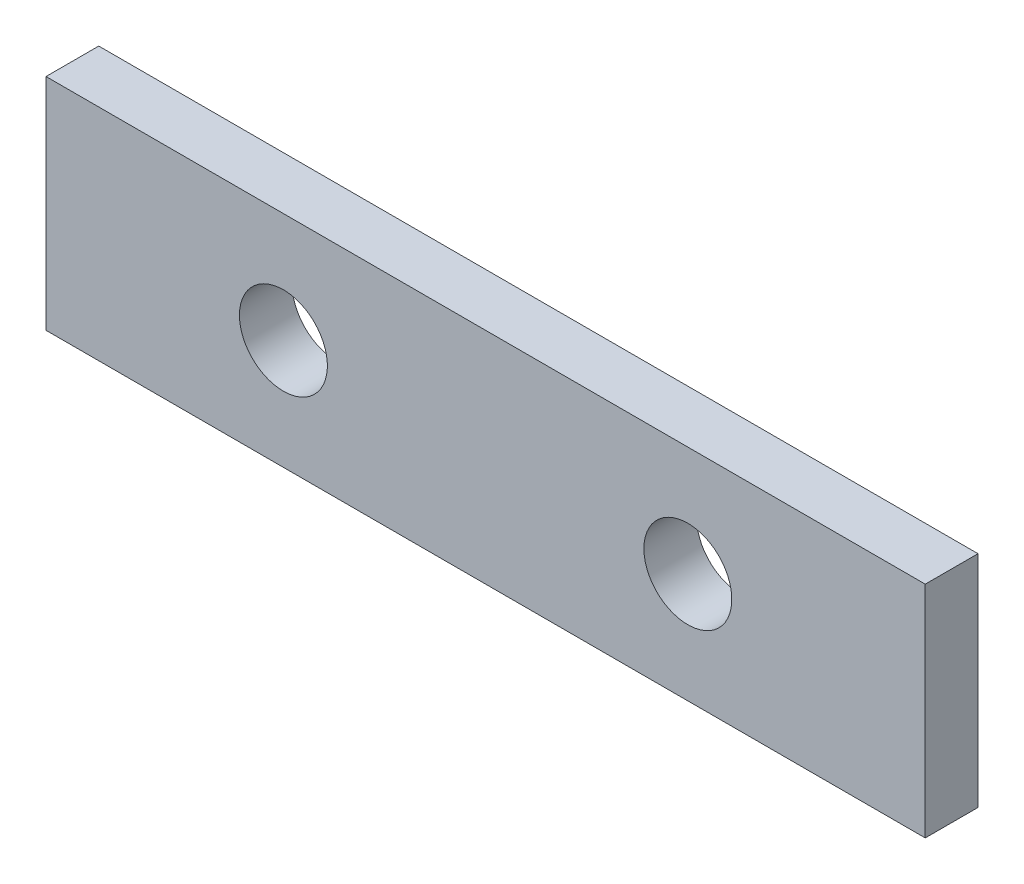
ISO-10303-21;
HEADER;
FILE_DESCRIPTION(('STEP AP214'),'2;1');
FILE_NAME('part.step','',(''),(''),'','','');
FILE_SCHEMA(('AUTOMOTIVE_DESIGN { 1 0 10303 214 1 1 1 1 }'));
ENDSEC;
DATA;
#1=APPLICATION_CONTEXT('core data for automotive mechanical design processes');
#2=APPLICATION_PROTOCOL_DEFINITION('international standard','automotive_design',2000,#1);
#3=PRODUCT_CONTEXT('',#1,'mechanical');
#4=PRODUCT('Part','Part','',(#3));
#5=PRODUCT_RELATED_PRODUCT_CATEGORY('part','',(#4));
#6=PRODUCT_DEFINITION_FORMATION('','',#4);
#7=PRODUCT_DEFINITION_CONTEXT('part definition',#1,'design');
#8=PRODUCT_DEFINITION('design','',#6,#7);
#9=PRODUCT_DEFINITION_SHAPE('','',#8);
#10=(LENGTH_UNIT() NAMED_UNIT(*) SI_UNIT(.MILLI.,.METRE.));
#11=(NAMED_UNIT(*) PLANE_ANGLE_UNIT() SI_UNIT($,.RADIAN.));
#12=(NAMED_UNIT(*) SI_UNIT($,.STERADIAN.) SOLID_ANGLE_UNIT());
#13=UNCERTAINTY_MEASURE_WITH_UNIT(LENGTH_MEASURE(1.E-05),#10,'distance_accuracy_value','');
#14=(GEOMETRIC_REPRESENTATION_CONTEXT(3) GLOBAL_UNCERTAINTY_ASSIGNED_CONTEXT((#13)) GLOBAL_UNIT_ASSIGNED_CONTEXT((#10,
#11,#12)) REPRESENTATION_CONTEXT('',''));
#15=CARTESIAN_POINT('',(0.,0.,0.));
#16=DIRECTION('',(0.,0.,1.));
#17=DIRECTION('',(1.,0.,0.));
#18=AXIS2_PLACEMENT_3D('',#15,#16,#17);
#19=CARTESIAN_POINT('',(0.,-50.,12.));
#20=DIRECTION('',(0.,0.,0.999999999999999));
#21=DIRECTION('',(1.,0.,0.));
#22=AXIS2_PLACEMENT_3D('',#19,#20,#21);
#23=PLANE('',#22);
#24=CARTESIAN_POINT('',(146.,-25.,11.9999999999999));
#25=DIRECTION('',(0.,0.,0.999999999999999));
#26=DIRECTION('',(1.,0.,0.));
#27=AXIS2_PLACEMENT_3D('',#24,#25,#26);
#28=CIRCLE('',#27,10.);
#29=CARTESIAN_POINT('',(136.,-25.,11.9999999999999));
#30=VERTEX_POINT('',#29);
#31=EDGE_CURVE('E83',#30,#30,#28,.T.);
#32=ORIENTED_EDGE('',*,*,#31,.F.);
#33=EDGE_LOOP('',(#32));
#34=FACE_BOUND('',#33,.T.);
#35=DIRECTION('',(0.,-1.,0.));
#36=VECTOR('',#35,1.);
#37=CARTESIAN_POINT('',(0.,0.,12.));
#38=LINE('',#37,#36);
#39=CARTESIAN_POINT('',(0.,0.,12.));
#40=VERTEX_POINT('',#39);
#41=CARTESIAN_POINT('',(0.,-50.,12.));
#42=VERTEX_POINT('',#41);
#43=EDGE_CURVE('E93',#40,#42,#38,.T.);
#44=ORIENTED_EDGE('',*,*,#43,.T.);
#45=DIRECTION('',(1.,0.,0.));
#46=VECTOR('',#45,1.);
#47=CARTESIAN_POINT('',(0.,-50.,12.));
#48=LINE('',#47,#46);
#49=CARTESIAN_POINT('',(200.,-50.,11.9999999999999));
#50=VERTEX_POINT('',#49);
#51=EDGE_CURVE('E78',#42,#50,#48,.T.);
#52=ORIENTED_EDGE('',*,*,#51,.T.);
#53=DIRECTION('',(0.,1.,0.));
#54=VECTOR('',#53,1.);
#55=CARTESIAN_POINT('',(200.,0.,11.9999999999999));
#56=LINE('',#55,#54);
#57=CARTESIAN_POINT('',(200.,0.,11.9999999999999));
#58=VERTEX_POINT('',#57);
#59=EDGE_CURVE('E44',#50,#58,#56,.T.);
#60=ORIENTED_EDGE('',*,*,#59,.T.);
#61=DIRECTION('',(-1.,0.,0.));
#62=VECTOR('',#61,1.);
#63=CARTESIAN_POINT('',(0.,0.,12.));
#64=LINE('',#63,#62);
#65=EDGE_CURVE('E39',#58,#40,#64,.T.);
#66=ORIENTED_EDGE('',*,*,#65,.T.);
#67=EDGE_LOOP('',(#44,#52,#60,#66));
#68=FACE_BOUND('',#67,.T.);
#69=CARTESIAN_POINT('',(54.0000000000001,-25.,12.));
#70=DIRECTION('',(0.,0.,0.999999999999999));
#71=DIRECTION('',(1.,0.,0.));
#72=AXIS2_PLACEMENT_3D('',#69,#70,#71);
#73=CIRCLE('',#72,10.);
#74=CARTESIAN_POINT('',(44.,-25.,12.));
#75=VERTEX_POINT('',#74);
#76=EDGE_CURVE('E111',#75,#75,#73,.T.);
#77=ORIENTED_EDGE('',*,*,#76,.F.);
#78=EDGE_LOOP('',(#77));
#79=FACE_BOUND('',#78,.T.);
#80=ADVANCED_FACE('F24',(#34,#68,#79),#23,.T.);
#81=CARTESIAN_POINT('',(0.,-50.,0.));
#82=DIRECTION('',(0.,0.,0.999999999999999));
#83=DIRECTION('',(1.,0.,0.));
#84=AXIS2_PLACEMENT_3D('',#81,#82,#83);
#85=PLANE('',#84);
#86=CARTESIAN_POINT('',(146.,-25.,0.));
#87=DIRECTION('',(0.,0.,0.999999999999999));
#88=DIRECTION('',(1.,0.,0.));
#89=AXIS2_PLACEMENT_3D('',#86,#87,#88);
#90=CIRCLE('',#89,10.);
#91=CARTESIAN_POINT('',(136.,-25.,0.));
#92=VERTEX_POINT('',#91);
#93=EDGE_CURVE('E86',#92,#92,#90,.T.);
#94=ORIENTED_EDGE('',*,*,#93,.T.);
#95=EDGE_LOOP('',(#94));
#96=FACE_BOUND('',#95,.T.);
#97=DIRECTION('',(0.,-1.,0.));
#98=VECTOR('',#97,1.);
#99=CARTESIAN_POINT('',(0.,0.,0.));
#100=LINE('',#99,#98);
#101=CARTESIAN_POINT('',(0.,0.,0.));
#102=VERTEX_POINT('',#101);
#103=CARTESIAN_POINT('',(0.,-50.,0.));
#104=VERTEX_POINT('',#103);
#105=EDGE_CURVE('E70',#102,#104,#100,.T.);
#106=ORIENTED_EDGE('',*,*,#105,.F.);
#107=DIRECTION('',(-1.,0.,0.));
#108=VECTOR('',#107,1.);
#109=CARTESIAN_POINT('',(0.,0.,0.));
#110=LINE('',#109,#108);
#111=CARTESIAN_POINT('',(200.,0.,0.));
#112=VERTEX_POINT('',#111);
#113=EDGE_CURVE('E91',#112,#102,#110,.T.);
#114=ORIENTED_EDGE('',*,*,#113,.F.);
#115=DIRECTION('',(0.,1.,0.));
#116=VECTOR('',#115,1.);
#117=CARTESIAN_POINT('',(200.,0.,0.));
#118=LINE('',#117,#116);
#119=CARTESIAN_POINT('',(200.,-50.,0.));
#120=VERTEX_POINT('',#119);
#121=EDGE_CURVE('E71',#120,#112,#118,.T.);
#122=ORIENTED_EDGE('',*,*,#121,.F.);
#123=DIRECTION('',(1.,0.,0.));
#124=VECTOR('',#123,1.);
#125=CARTESIAN_POINT('',(0.,-50.,0.));
#126=LINE('',#125,#124);
#127=EDGE_CURVE('E65',#104,#120,#126,.T.);
#128=ORIENTED_EDGE('',*,*,#127,.F.);
#129=EDGE_LOOP('',(#106,#114,#122,#128));
#130=FACE_BOUND('',#129,.T.);
#131=CARTESIAN_POINT('',(54.0000000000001,-25.,0.));
#132=DIRECTION('',(0.,0.,0.999999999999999));
#133=DIRECTION('',(1.,0.,0.));
#134=AXIS2_PLACEMENT_3D('',#131,#132,#133);
#135=CIRCLE('',#134,10.);
#136=CARTESIAN_POINT('',(44.,-25.,0.));
#137=VERTEX_POINT('',#136);
#138=EDGE_CURVE('E113',#137,#137,#135,.T.);
#139=ORIENTED_EDGE('',*,*,#138,.T.);
#140=EDGE_LOOP('',(#139));
#141=FACE_BOUND('',#140,.T.);
#142=ADVANCED_FACE('F66',(#96,#130,#141),#85,.F.);
#143=CARTESIAN_POINT('',(0.,0.,12.));
#144=DIRECTION('',(1.,0.,0.));
#145=DIRECTION('',(0.,1.,0.));
#146=AXIS2_PLACEMENT_3D('',#143,#144,#145);
#147=PLANE('',#146);
#148=ORIENTED_EDGE('',*,*,#105,.T.);
#149=DIRECTION('',(0.,0.,-0.999999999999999));
#150=VECTOR('',#149,1.);
#151=CARTESIAN_POINT('',(0.,-50.,12.));
#152=LINE('',#151,#150);
#153=EDGE_CURVE('E11',#42,#104,#152,.T.);
#154=ORIENTED_EDGE('',*,*,#153,.F.);
#155=ORIENTED_EDGE('',*,*,#43,.F.);
#156=DIRECTION('',(0.,0.,-0.999999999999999));
#157=VECTOR('',#156,1.);
#158=CARTESIAN_POINT('',(0.,0.,12.));
#159=LINE('',#158,#157);
#160=EDGE_CURVE('E82',#40,#102,#159,.T.);
#161=ORIENTED_EDGE('',*,*,#160,.T.);
#162=EDGE_LOOP('',(#148,#154,#155,#161));
#163=FACE_BOUND('',#162,.T.);
#164=ADVANCED_FACE('F26',(#163),#147,.F.);
#165=CARTESIAN_POINT('',(0.,-50.,12.));
#166=DIRECTION('',(0.,1.,0.));
#167=DIRECTION('',(0.,0.,0.999999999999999));
#168=AXIS2_PLACEMENT_3D('',#165,#166,#167);
#169=PLANE('',#168);
#170=ORIENTED_EDGE('',*,*,#127,.T.);
#171=DIRECTION('',(0.,0.,-0.999999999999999));
#172=VECTOR('',#171,1.);
#173=CARTESIAN_POINT('',(200.,-50.,11.9999999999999));
#174=LINE('',#173,#172);
#175=EDGE_CURVE('E32',#50,#120,#174,.T.);
#176=ORIENTED_EDGE('',*,*,#175,.F.);
#177=ORIENTED_EDGE('',*,*,#51,.F.);
#178=ORIENTED_EDGE('',*,*,#153,.T.);
#179=EDGE_LOOP('',(#170,#176,#177,#178));
#180=FACE_BOUND('',#179,.T.);
#181=ADVANCED_FACE('F77',(#180),#169,.F.);
#182=CARTESIAN_POINT('',(200.,0.,11.9999999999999));
#183=DIRECTION('',(-1.,0.,0.));
#184=DIRECTION('',(0.,0.,0.999999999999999));
#185=AXIS2_PLACEMENT_3D('',#182,#183,#184);
#186=PLANE('',#185);
#187=ORIENTED_EDGE('',*,*,#121,.T.);
#188=DIRECTION('',(0.,0.,-0.999999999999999));
#189=VECTOR('',#188,1.);
#190=CARTESIAN_POINT('',(200.,0.,11.9999999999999));
#191=LINE('',#190,#189);
#192=EDGE_CURVE('E99',#58,#112,#191,.T.);
#193=ORIENTED_EDGE('',*,*,#192,.F.);
#194=ORIENTED_EDGE('',*,*,#59,.F.);
#195=ORIENTED_EDGE('',*,*,#175,.T.);
#196=EDGE_LOOP('',(#187,#193,#194,#195));
#197=FACE_BOUND('',#196,.T.);
#198=ADVANCED_FACE('F102',(#197),#186,.F.);
#199=CARTESIAN_POINT('',(0.,0.,12.));
#200=DIRECTION('',(0.,-1.,0.));
#201=DIRECTION('',(0.,0.,-0.999999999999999));
#202=AXIS2_PLACEMENT_3D('',#199,#200,#201);
#203=PLANE('',#202);
#204=ORIENTED_EDGE('',*,*,#113,.T.);
#205=ORIENTED_EDGE('',*,*,#160,.F.);
#206=ORIENTED_EDGE('',*,*,#65,.F.);
#207=ORIENTED_EDGE('',*,*,#192,.T.);
#208=EDGE_LOOP('',(#204,#205,#206,#207));
#209=FACE_BOUND('',#208,.T.);
#210=ADVANCED_FACE('F104',(#209),#203,.F.);
#211=CARTESIAN_POINT('',(146.,-25.,11.9999999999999));
#212=DIRECTION('',(0.,0.,-0.999999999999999));
#213=DIRECTION('',(-1.,0.,0.));
#214=AXIS2_PLACEMENT_3D('',#211,#212,#213);
#215=CYLINDRICAL_SURFACE('',#214,10.);
#216=CARTESIAN_POINT('',(136.,-25.,11.9999999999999));
#217=CARTESIAN_POINT('',(136.,-25.,11.8749999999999));
#218=CARTESIAN_POINT('',(136.,-25.,11.7499999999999));
#219=CARTESIAN_POINT('',(136.,-25.,11.4999999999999));
#220=CARTESIAN_POINT('',(136.,-25.,11.3749999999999));
#221=CARTESIAN_POINT('',(136.,-25.,11.1249999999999));
#222=CARTESIAN_POINT('',(136.,-25.,10.9999999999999));
#223=CARTESIAN_POINT('',(136.,-25.,10.7499999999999));
#224=CARTESIAN_POINT('',(136.,-25.,10.6249999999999));
#225=CARTESIAN_POINT('',(136.,-25.,10.3749999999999));
#226=CARTESIAN_POINT('',(136.,-25.,10.2499999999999));
#227=CARTESIAN_POINT('',(136.,-25.,9.99999999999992));
#228=CARTESIAN_POINT('',(136.,-25.,9.87499999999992));
#229=CARTESIAN_POINT('',(136.,-25.,9.62499999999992));
#230=CARTESIAN_POINT('',(136.,-25.,9.49999999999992));
#231=CARTESIAN_POINT('',(136.,-25.,9.24999999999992));
#232=CARTESIAN_POINT('',(136.,-25.,9.12499999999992));
#233=CARTESIAN_POINT('',(136.,-25.,8.87499999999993));
#234=CARTESIAN_POINT('',(136.,-25.,8.74999999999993));
#235=CARTESIAN_POINT('',(136.,-25.,8.49999999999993));
#236=CARTESIAN_POINT('',(136.,-25.,8.37499999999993));
#237=CARTESIAN_POINT('',(136.,-25.,8.12499999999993));
#238=CARTESIAN_POINT('',(136.,-25.,7.99999999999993));
#239=CARTESIAN_POINT('',(136.,-25.,7.74999999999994));
#240=CARTESIAN_POINT('',(136.,-25.,7.62499999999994));
#241=CARTESIAN_POINT('',(136.,-25.,7.37499999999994));
#242=CARTESIAN_POINT('',(136.,-25.,7.24999999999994));
#243=CARTESIAN_POINT('',(136.,-25.,6.99999999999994));
#244=CARTESIAN_POINT('',(136.,-25.,6.87499999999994));
#245=CARTESIAN_POINT('',(136.,-25.,6.62499999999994));
#246=CARTESIAN_POINT('',(136.,-25.,6.49999999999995));
#247=CARTESIAN_POINT('',(136.,-25.,6.24999999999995));
#248=CARTESIAN_POINT('',(136.,-25.,6.12499999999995));
#249=CARTESIAN_POINT('',(136.,-25.,5.87499999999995));
#250=CARTESIAN_POINT('',(136.,-25.,5.74999999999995));
#251=CARTESIAN_POINT('',(136.,-25.,5.49999999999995));
#252=CARTESIAN_POINT('',(136.,-25.,5.37499999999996));
#253=CARTESIAN_POINT('',(136.,-25.,5.12499999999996));
#254=CARTESIAN_POINT('',(136.,-25.,4.99999999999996));
#255=CARTESIAN_POINT('',(136.,-25.,4.74999999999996));
#256=CARTESIAN_POINT('',(136.,-25.,4.62499999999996));
#257=CARTESIAN_POINT('',(136.,-25.,4.37499999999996));
#258=CARTESIAN_POINT('',(136.,-25.,4.24999999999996));
#259=CARTESIAN_POINT('',(136.,-25.,3.99999999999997));
#260=CARTESIAN_POINT('',(136.,-25.,3.87499999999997));
#261=CARTESIAN_POINT('',(136.,-25.,3.62499999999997));
#262=CARTESIAN_POINT('',(136.,-25.,3.49999999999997));
#263=CARTESIAN_POINT('',(136.,-25.,3.24999999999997));
#264=CARTESIAN_POINT('',(136.,-25.,3.12499999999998));
#265=CARTESIAN_POINT('',(136.,-25.,2.87499999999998));
#266=CARTESIAN_POINT('',(136.,-25.,2.74999999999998));
#267=CARTESIAN_POINT('',(136.,-25.,2.49999999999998));
#268=CARTESIAN_POINT('',(136.,-25.,2.37499999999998));
#269=CARTESIAN_POINT('',(136.,-25.,2.12499999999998));
#270=CARTESIAN_POINT('',(136.,-25.,1.99999999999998));
#271=CARTESIAN_POINT('',(136.,-25.,1.74999999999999));
#272=CARTESIAN_POINT('',(136.,-25.,1.62499999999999));
#273=CARTESIAN_POINT('',(136.,-25.,1.37499999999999));
#274=CARTESIAN_POINT('',(136.,-25.,1.24999999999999));
#275=CARTESIAN_POINT('',(136.,-25.,0.999999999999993));
#276=CARTESIAN_POINT('',(136.,-25.,0.874999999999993));
#277=CARTESIAN_POINT('',(136.,-25.,0.624999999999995));
#278=CARTESIAN_POINT('',(136.,-25.,0.499999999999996));
#279=CARTESIAN_POINT('',(136.,-25.,0.249999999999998));
#280=CARTESIAN_POINT('',(136.,-25.,0.124999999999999));
#281=CARTESIAN_POINT('',(136.,-25.,0.));
#282=B_SPLINE_CURVE_WITH_KNOTS('',3,(#216,#217,#218,#219,#220,#221,#222,#223,#224,#225,#226,
#227,#228,#229,#230,#231,#232,#233,#234,#235,#236,#237,#238,#239,#240,#241,#242,#243,#244,#245,
#246,#247,#248,#249,#250,#251,#252,#253,#254,#255,#256,#257,#258,#259,#260,#261,#262,#263,#264,
#265,#266,#267,#268,#269,#270,#271,#272,#273,#274,#275,#276,#277,#278,#279,#280,#281),
.UNSPECIFIED.,.F.,.F.,(4,2,2,2,2,2,2,2,2,2,2,2,2,2,2,2,2,2,2,2,2,2,2,2,2,2,2,2,2,2,2,2,4),(0.,
0.374999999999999,0.749999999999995,1.12499999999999,1.49999999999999,1.87499999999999,
2.24999999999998,2.62499999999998,2.99999999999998,3.37499999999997,3.74999999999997,
4.12499999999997,4.49999999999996,4.87499999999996,5.24999999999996,5.62499999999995,
5.99999999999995,6.37499999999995,6.74999999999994,7.12499999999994,7.49999999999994,
7.87499999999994,8.24999999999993,8.62499999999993,8.99999999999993,9.37499999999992,
9.74999999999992,10.1249999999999,10.4999999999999,10.8749999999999,11.2499999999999,
11.6249999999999,11.9999999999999),.UNSPECIFIED.);
#283=EDGE_CURVE('BSEAM122',#30,#92,#282,.T.);
#284=ORIENTED_EDGE('',*,*,#31,.T.);
#285=ORIENTED_EDGE('',*,*,#93,.F.);
#286=ORIENTED_EDGE('',*,*,#283,.T.);
#287=ORIENTED_EDGE('',*,*,#283,.F.);
#288=EDGE_LOOP('',(#284,#286,#285,#287));
#289=FACE_BOUND('',#288,.T.);
#290=ADVANCED_FACE('F122',(#289),#215,.F.);
#291=CARTESIAN_POINT('',(54.0000000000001,-25.,12.));
#292=DIRECTION('',(0.,0.,-0.999999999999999));
#293=DIRECTION('',(-1.,0.,0.));
#294=AXIS2_PLACEMENT_3D('',#291,#292,#293);
#295=CYLINDRICAL_SURFACE('',#294,10.);
#296=CARTESIAN_POINT('',(44.,-25.,12.));
#297=CARTESIAN_POINT('',(44.,-25.,11.875));
#298=CARTESIAN_POINT('',(44.,-25.,11.75));
#299=CARTESIAN_POINT('',(44.,-25.,11.5));
#300=CARTESIAN_POINT('',(44.,-25.,11.375));
#301=CARTESIAN_POINT('',(44.,-25.,11.125));
#302=CARTESIAN_POINT('',(44.,-25.,11.));
#303=CARTESIAN_POINT('',(44.,-25.,10.75));
#304=CARTESIAN_POINT('',(44.,-25.,10.625));
#305=CARTESIAN_POINT('',(44.,-25.,10.375));
#306=CARTESIAN_POINT('',(44.,-25.,10.25));
#307=CARTESIAN_POINT('',(44.,-25.,10.));
#308=CARTESIAN_POINT('',(44.,-25.,9.875));
#309=CARTESIAN_POINT('',(44.,-25.,9.625));
#310=CARTESIAN_POINT('',(44.,-25.,9.5));
#311=CARTESIAN_POINT('',(44.,-25.,9.25));
#312=CARTESIAN_POINT('',(44.,-25.,9.125));
#313=CARTESIAN_POINT('',(44.,-25.,8.875));
#314=CARTESIAN_POINT('',(44.,-25.,8.75));
#315=CARTESIAN_POINT('',(44.,-25.,8.5));
#316=CARTESIAN_POINT('',(44.,-25.,8.37500000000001));
#317=CARTESIAN_POINT('',(44.,-25.,8.12500000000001));
#318=CARTESIAN_POINT('',(44.,-25.,8.00000000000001));
#319=CARTESIAN_POINT('',(44.,-25.,7.75000000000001));
#320=CARTESIAN_POINT('',(44.,-25.,7.62500000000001));
#321=CARTESIAN_POINT('',(44.,-25.,7.37500000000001));
#322=CARTESIAN_POINT('',(44.,-25.,7.25000000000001));
#323=CARTESIAN_POINT('',(44.,-25.,7.00000000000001));
#324=CARTESIAN_POINT('',(44.,-25.,6.87500000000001));
#325=CARTESIAN_POINT('',(44.,-25.,6.62500000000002));
#326=CARTESIAN_POINT('',(44.,-25.,6.50000000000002));
#327=CARTESIAN_POINT('',(44.,-25.,6.25000000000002));
#328=CARTESIAN_POINT('',(44.,-25.,6.12500000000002));
#329=CARTESIAN_POINT('',(44.,-25.,5.87500000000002));
#330=CARTESIAN_POINT('',(44.,-25.,5.75000000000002));
#331=CARTESIAN_POINT('',(44.,-25.,5.50000000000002));
#332=CARTESIAN_POINT('',(44.,-25.,5.37500000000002));
#333=CARTESIAN_POINT('',(44.,-25.,5.12500000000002));
#334=CARTESIAN_POINT('',(44.,-25.,5.00000000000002));
#335=CARTESIAN_POINT('',(44.,-25.,4.75000000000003));
#336=CARTESIAN_POINT('',(44.,-25.,4.62500000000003));
#337=CARTESIAN_POINT('',(44.,-25.,4.37500000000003));
#338=CARTESIAN_POINT('',(44.,-25.,4.25000000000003));
#339=CARTESIAN_POINT('',(44.,-25.,4.00000000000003));
#340=CARTESIAN_POINT('',(44.,-25.,3.87500000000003));
#341=CARTESIAN_POINT('',(44.,-25.,3.62500000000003));
#342=CARTESIAN_POINT('',(44.,-25.,3.50000000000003));
#343=CARTESIAN_POINT('',(44.,-25.,3.25000000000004));
#344=CARTESIAN_POINT('',(44.,-25.,3.12500000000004));
#345=CARTESIAN_POINT('',(44.,-25.,2.87500000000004));
#346=CARTESIAN_POINT('',(44.,-25.,2.75000000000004));
#347=CARTESIAN_POINT('',(44.,-25.,2.50000000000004));
#348=CARTESIAN_POINT('',(44.,-25.,2.37500000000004));
#349=CARTESIAN_POINT('',(44.,-25.,2.12500000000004));
#350=CARTESIAN_POINT('',(44.,-25.,2.00000000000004));
#351=CARTESIAN_POINT('',(44.,-25.,1.75000000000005));
#352=CARTESIAN_POINT('',(44.,-25.,1.62500000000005));
#353=CARTESIAN_POINT('',(44.,-25.,1.37500000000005));
#354=CARTESIAN_POINT('',(44.,-25.,1.25000000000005));
#355=CARTESIAN_POINT('',(44.,-25.,1.00000000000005));
#356=CARTESIAN_POINT('',(44.,-25.,0.87500000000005));
#357=CARTESIAN_POINT('',(44.,-25.,0.625000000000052));
#358=CARTESIAN_POINT('',(44.,-25.,0.500000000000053));
#359=CARTESIAN_POINT('',(44.,-25.,0.250000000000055));
#360=CARTESIAN_POINT('',(44.,-25.,0.125000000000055));
#361=CARTESIAN_POINT('',(44.,-25.,0.));
#362=B_SPLINE_CURVE_WITH_KNOTS('',3,(#296,#297,#298,#299,#300,#301,#302,#303,#304,#305,#306,
#307,#308,#309,#310,#311,#312,#313,#314,#315,#316,#317,#318,#319,#320,#321,#322,#323,#324,#325,
#326,#327,#328,#329,#330,#331,#332,#333,#334,#335,#336,#337,#338,#339,#340,#341,#342,#343,#344,
#345,#346,#347,#348,#349,#350,#351,#352,#353,#354,#355,#356,#357,#358,#359,#360,#361),
.UNSPECIFIED.,.F.,.F.,(4,2,2,2,2,2,2,2,2,2,2,2,2,2,2,2,2,2,2,2,2,2,2,2,2,2,2,2,2,2,2,2,4),(0.,
0.374999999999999,0.749999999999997,1.12499999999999,1.49999999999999,1.87499999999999,
2.24999999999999,2.62499999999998,2.99999999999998,3.37499999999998,3.74999999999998,
4.12499999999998,4.49999999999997,4.87499999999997,5.24999999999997,5.62499999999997,
5.99999999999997,6.37499999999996,6.74999999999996,7.12499999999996,7.49999999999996,
7.87499999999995,8.24999999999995,8.62499999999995,8.99999999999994,9.37499999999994,
9.74999999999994,10.1249999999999,10.4999999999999,10.8749999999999,11.2499999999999,
11.6249999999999,11.9999999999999),.UNSPECIFIED.);
#363=EDGE_CURVE('BSEAM120',#75,#137,#362,.T.);
#364=ORIENTED_EDGE('',*,*,#76,.T.);
#365=ORIENTED_EDGE('',*,*,#138,.F.);
#366=ORIENTED_EDGE('',*,*,#363,.T.);
#367=ORIENTED_EDGE('',*,*,#363,.F.);
#368=EDGE_LOOP('',(#364,#366,#365,#367));
#369=FACE_BOUND('',#368,.T.);
#370=ADVANCED_FACE('F120',(#369),#295,.F.);
#371=CLOSED_SHELL('',(#80,#142,#164,#181,#198,#210,#290,#370));
#372=MANIFOLD_SOLID_BREP('B2',#371);
#373=ADVANCED_BREP_SHAPE_REPRESENTATION('',(#18,#372),#14);
#374=SHAPE_DEFINITION_REPRESENTATION(#9,#373);
ENDSEC;
END-ISO-10303-21;
